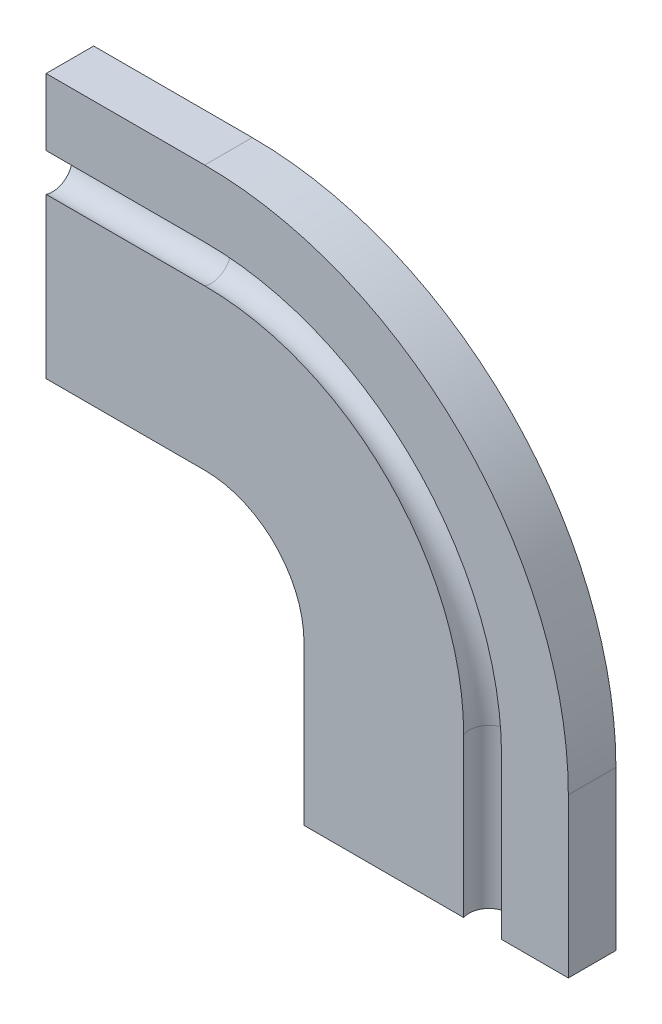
ISO-10303-21;
HEADER;
FILE_DESCRIPTION(('STEP AP214'),'2;1');
FILE_NAME('part.step','',(''),(''),'','','');
FILE_SCHEMA(('AUTOMOTIVE_DESIGN { 1 0 10303 214 1 1 1 1 }'));
ENDSEC;
DATA;
#1=APPLICATION_CONTEXT('core data for automotive mechanical design processes');
#2=APPLICATION_PROTOCOL_DEFINITION('international standard','automotive_design',2000,#1);
#3=PRODUCT_CONTEXT('',#1,'mechanical');
#4=PRODUCT('Part','Part','',(#3));
#5=PRODUCT_RELATED_PRODUCT_CATEGORY('part','',(#4));
#6=PRODUCT_DEFINITION_FORMATION('','',#4);
#7=PRODUCT_DEFINITION_CONTEXT('part definition',#1,'design');
#8=PRODUCT_DEFINITION('design','',#6,#7);
#9=PRODUCT_DEFINITION_SHAPE('','',#8);
#10=(LENGTH_UNIT() NAMED_UNIT(*) SI_UNIT(.MILLI.,.METRE.));
#11=(NAMED_UNIT(*) PLANE_ANGLE_UNIT() SI_UNIT($,.RADIAN.));
#12=(NAMED_UNIT(*) SI_UNIT($,.STERADIAN.) SOLID_ANGLE_UNIT());
#13=UNCERTAINTY_MEASURE_WITH_UNIT(LENGTH_MEASURE(1.E-05),#10,'distance_accuracy_value','');
#14=(GEOMETRIC_REPRESENTATION_CONTEXT(3) GLOBAL_UNCERTAINTY_ASSIGNED_CONTEXT((#13)) GLOBAL_UNIT_ASSIGNED_CONTEXT((#10,
#11,#12)) REPRESENTATION_CONTEXT('',''));
#15=CARTESIAN_POINT('',(0.,0.,0.));
#16=DIRECTION('',(0.,0.,1.));
#17=DIRECTION('',(1.,0.,0.));
#18=AXIS2_PLACEMENT_3D('',#15,#16,#17);
#19=CARTESIAN_POINT('',(-20.,82.572,0.));
#20=DIRECTION('',(-1.,0.,0.));
#21=DIRECTION('',(0.,0.,1.));
#22=AXIS2_PLACEMENT_3D('',#19,#20,#21);
#23=CYLINDRICAL_SURFACE('',#22,3.786);
#24=CARTESIAN_POINT('',(-20.,82.572,0.));
#25=DIRECTION('',(1.,0.,0.));
#26=DIRECTION('',(0.,0.,-1.));
#27=AXIS2_PLACEMENT_3D('',#24,#25,#26);
#28=CIRCLE('',#27,3.786);
#29=CARTESIAN_POINT('',(-20.,78.9859157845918,1.214));
#30=VERTEX_POINT('',#29);
#31=CARTESIAN_POINT('',(-20.,86.1580842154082,1.214));
#32=VERTEX_POINT('',#31);
#33=EDGE_CURVE('E237',#30,#32,#28,.T.);
#34=ORIENTED_EDGE('',*,*,#33,.T.);
#35=DIRECTION('',(-1.,0.,0.));
#36=VECTOR('',#35,1.);
#37=CARTESIAN_POINT('',(-20.,86.1580842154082,1.214));
#38=LINE('',#37,#36);
#39=CARTESIAN_POINT('',(-50.,86.1580842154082,1.214));
#40=VERTEX_POINT('',#39);
#41=EDGE_CURVE('E327',#32,#40,#38,.T.);
#42=ORIENTED_EDGE('',*,*,#41,.T.);
#43=CARTESIAN_POINT('',(-50.,82.572,0.));
#44=DIRECTION('',(1.,0.,0.));
#45=DIRECTION('',(0.,0.,-1.));
#46=AXIS2_PLACEMENT_3D('',#43,#44,#45);
#47=CIRCLE('',#46,3.786);
#48=CARTESIAN_POINT('',(-50.,78.9859157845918,1.214));
#49=VERTEX_POINT('',#48);
#50=EDGE_CURVE('E52',#49,#40,#47,.T.);
#51=ORIENTED_EDGE('',*,*,#50,.F.);
#52=DIRECTION('',(-1.,0.,0.));
#53=VECTOR('',#52,1.);
#54=CARTESIAN_POINT('',(-20.,78.9859157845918,1.214));
#55=LINE('',#54,#53);
#56=EDGE_CURVE('E37',#30,#49,#55,.T.);
#57=ORIENTED_EDGE('',*,*,#56,.F.);
#58=EDGE_LOOP('',(#34,#42,#51,#57));
#59=FACE_BOUND('',#58,.T.);
#60=ADVANCED_FACE('F30',(#59),#23,.F.);
#61=CARTESIAN_POINT('',(-20.,98.786,1.214));
#62=DIRECTION('',(0.,1.,0.));
#63=DIRECTION('',(0.,0.,1.));
#64=AXIS2_PLACEMENT_3D('',#61,#62,#63);
#65=PLANE('',#64);
#66=DIRECTION('',(0.,0.,-1.));
#67=VECTOR('',#66,1.);
#68=CARTESIAN_POINT('',(-20.,98.786,1.214));
#69=LINE('',#68,#67);
#70=CARTESIAN_POINT('',(-20.,98.786,1.214));
#71=VERTEX_POINT('',#70);
#72=CARTESIAN_POINT('',(-20.,98.786,-7.78600000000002));
#73=VERTEX_POINT('',#72);
#74=EDGE_CURVE('E234',#71,#73,#69,.T.);
#75=ORIENTED_EDGE('',*,*,#74,.T.);
#76=DIRECTION('',(-1.,0.,0.));
#77=VECTOR('',#76,1.);
#78=CARTESIAN_POINT('',(-20.,98.786,-7.78600000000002));
#79=LINE('',#78,#77);
#80=CARTESIAN_POINT('',(-50.,98.786,-7.78600000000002));
#81=VERTEX_POINT('',#80);
#82=EDGE_CURVE('E321',#73,#81,#79,.T.);
#83=ORIENTED_EDGE('',*,*,#82,.T.);
#84=DIRECTION('',(0.,0.,-1.));
#85=VECTOR('',#84,1.);
#86=CARTESIAN_POINT('',(-50.,98.786,1.214));
#87=LINE('',#86,#85);
#88=CARTESIAN_POINT('',(-50.,98.786,1.214));
#89=VERTEX_POINT('',#88);
#90=EDGE_CURVE('E292',#89,#81,#87,.T.);
#91=ORIENTED_EDGE('',*,*,#90,.F.);
#92=DIRECTION('',(-1.,0.,0.));
#93=VECTOR('',#92,1.);
#94=CARTESIAN_POINT('',(-20.,98.786,1.214));
#95=LINE('',#94,#93);
#96=EDGE_CURVE('E324',#71,#89,#95,.T.);
#97=ORIENTED_EDGE('',*,*,#96,.F.);
#98=EDGE_LOOP('',(#75,#83,#91,#97));
#99=FACE_BOUND('',#98,.T.);
#100=ADVANCED_FACE('F452',(#99),#65,.T.);
#101=CARTESIAN_POINT('',(-20.,97.572,-7.78600000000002));
#102=DIRECTION('',(0.,-1.,0.));
#103=DIRECTION('',(0.,0.,-1.));
#104=AXIS2_PLACEMENT_3D('',#101,#102,#103);
#105=PLANE('',#104);
#106=DIRECTION('',(0.,0.,1.));
#107=VECTOR('',#106,1.);
#108=CARTESIAN_POINT('',(-20.,97.572,-7.78600000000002));
#109=LINE('',#108,#107);
#110=CARTESIAN_POINT('',(-20.,97.572,-7.78600000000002));
#111=VERTEX_POINT('',#110);
#112=CARTESIAN_POINT('',(-20.,97.572,0.));
#113=VERTEX_POINT('',#112);
#114=EDGE_CURVE('E231',#111,#113,#109,.T.);
#115=ORIENTED_EDGE('',*,*,#114,.T.);
#116=DIRECTION('',(-1.,0.,0.));
#117=VECTOR('',#116,1.);
#118=CARTESIAN_POINT('',(-20.,97.572,0.));
#119=LINE('',#118,#117);
#120=CARTESIAN_POINT('',(-50.,97.572,0.));
#121=VERTEX_POINT('',#120);
#122=EDGE_CURVE('E315',#113,#121,#119,.T.);
#123=ORIENTED_EDGE('',*,*,#122,.T.);
#124=DIRECTION('',(0.,0.,1.));
#125=VECTOR('',#124,1.);
#126=CARTESIAN_POINT('',(-50.,97.572,-7.78600000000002));
#127=LINE('',#126,#125);
#128=CARTESIAN_POINT('',(-50.,97.572,-7.78600000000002));
#129=VERTEX_POINT('',#128);
#130=EDGE_CURVE('E286',#129,#121,#127,.T.);
#131=ORIENTED_EDGE('',*,*,#130,.F.);
#132=DIRECTION('',(-1.,0.,0.));
#133=VECTOR('',#132,1.);
#134=CARTESIAN_POINT('',(-20.,97.572,-7.78600000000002));
#135=LINE('',#134,#133);
#136=EDGE_CURVE('E318',#111,#129,#135,.T.);
#137=ORIENTED_EDGE('',*,*,#136,.F.);
#138=EDGE_LOOP('',(#115,#123,#131,#137));
#139=FACE_BOUND('',#138,.T.);
#140=ADVANCED_FACE('F455',(#139),#105,.T.);
#141=CARTESIAN_POINT('',(-20.,82.572,0.));
#142=DIRECTION('',(-1.,0.,0.));
#143=DIRECTION('',(0.,0.,1.));
#144=AXIS2_PLACEMENT_3D('',#141,#142,#143);
#145=CYLINDRICAL_SURFACE('',#144,5.);
#146=CARTESIAN_POINT('',(-20.,82.572,0.));
#147=DIRECTION('',(-1.,0.,0.));
#148=DIRECTION('',(0.,0.,-1.));
#149=AXIS2_PLACEMENT_3D('',#146,#147,#148);
#150=CIRCLE('',#149,5.);
#151=CARTESIAN_POINT('',(-20.,87.572,0.));
#152=VERTEX_POINT('',#151);
#153=CARTESIAN_POINT('',(-20.,77.572,0.));
#154=VERTEX_POINT('',#153);
#155=EDGE_CURVE('E228',#152,#154,#150,.T.);
#156=ORIENTED_EDGE('',*,*,#155,.T.);
#157=DIRECTION('',(-1.,0.,0.));
#158=VECTOR('',#157,1.);
#159=CARTESIAN_POINT('',(-20.,77.572,0.));
#160=LINE('',#159,#158);
#161=CARTESIAN_POINT('',(-50.,77.572,0.));
#162=VERTEX_POINT('',#161);
#163=EDGE_CURVE('E309',#154,#162,#160,.T.);
#164=ORIENTED_EDGE('',*,*,#163,.T.);
#165=CARTESIAN_POINT('',(-50.,82.572,0.));
#166=DIRECTION('',(-1.,0.,0.));
#167=DIRECTION('',(0.,0.,-1.));
#168=AXIS2_PLACEMENT_3D('',#165,#166,#167);
#169=CIRCLE('',#168,5.);
#170=CARTESIAN_POINT('',(-50.,87.572,0.));
#171=VERTEX_POINT('',#170);
#172=EDGE_CURVE('E280',#171,#162,#169,.T.);
#173=ORIENTED_EDGE('',*,*,#172,.F.);
#174=DIRECTION('',(-1.,0.,0.));
#175=VECTOR('',#174,1.);
#176=CARTESIAN_POINT('',(-20.,87.572,0.));
#177=LINE('',#176,#175);
#178=EDGE_CURVE('E312',#152,#171,#177,.T.);
#179=ORIENTED_EDGE('',*,*,#178,.F.);
#180=EDGE_LOOP('',(#156,#164,#173,#179));
#181=FACE_BOUND('',#180,.T.);
#182=ADVANCED_FACE('F474',(#181),#145,.T.);
#183=CARTESIAN_POINT('',(-20.,50.,0.));
#184=DIRECTION('',(0.,1.,0.));
#185=DIRECTION('',(0.,0.,1.));
#186=AXIS2_PLACEMENT_3D('',#183,#184,#185);
#187=PLANE('',#186);
#188=DIRECTION('',(0.,0.,-1.));
#189=VECTOR('',#188,1.);
#190=CARTESIAN_POINT('',(-20.,50.,0.));
#191=LINE('',#190,#189);
#192=CARTESIAN_POINT('',(-20.,50.,0.));
#193=VERTEX_POINT('',#192);
#194=CARTESIAN_POINT('',(-20.,50.,-7.786));
#195=VERTEX_POINT('',#194);
#196=EDGE_CURVE('E219',#193,#195,#191,.T.);
#197=ORIENTED_EDGE('',*,*,#196,.T.);
#198=DIRECTION('',(-1.,0.,0.));
#199=VECTOR('',#198,1.);
#200=CARTESIAN_POINT('',(-20.,50.,-7.786));
#201=LINE('',#200,#199);
#202=CARTESIAN_POINT('',(-50.,50.,-7.786));
#203=VERTEX_POINT('',#202);
#204=EDGE_CURVE('E303',#195,#203,#201,.T.);
#205=ORIENTED_EDGE('',*,*,#204,.T.);
#206=DIRECTION('',(0.,0.,-1.));
#207=VECTOR('',#206,1.);
#208=CARTESIAN_POINT('',(-50.,50.,0.));
#209=LINE('',#208,#207);
#210=CARTESIAN_POINT('',(-50.,50.,0.));
#211=VERTEX_POINT('',#210);
#212=EDGE_CURVE('E274',#211,#203,#209,.T.);
#213=ORIENTED_EDGE('',*,*,#212,.F.);
#214=DIRECTION('',(-1.,0.,0.));
#215=VECTOR('',#214,1.);
#216=CARTESIAN_POINT('',(-20.,50.,0.));
#217=LINE('',#216,#215);
#218=EDGE_CURVE('E306',#193,#211,#217,.T.);
#219=ORIENTED_EDGE('',*,*,#218,.F.);
#220=EDGE_LOOP('',(#197,#205,#213,#219));
#221=FACE_BOUND('',#220,.T.);
#222=ADVANCED_FACE('F479',(#221),#187,.T.);
#223=CARTESIAN_POINT('',(-20.,48.786,-7.786));
#224=DIRECTION('',(0.,-1.,0.));
#225=DIRECTION('',(0.,0.,-1.));
#226=AXIS2_PLACEMENT_3D('',#223,#224,#225);
#227=PLANE('',#226);
#228=DIRECTION('',(0.,0.,1.));
#229=VECTOR('',#228,1.);
#230=CARTESIAN_POINT('',(-20.,48.786,-7.786));
#231=LINE('',#230,#229);
#232=CARTESIAN_POINT('',(-20.,48.786,-7.786));
#233=VERTEX_POINT('',#232);
#234=CARTESIAN_POINT('',(-20.,48.786,1.214));
#235=VERTEX_POINT('',#234);
#236=EDGE_CURVE('E216',#233,#235,#231,.T.);
#237=ORIENTED_EDGE('',*,*,#236,.T.);
#238=DIRECTION('',(-1.,0.,0.));
#239=VECTOR('',#238,1.);
#240=CARTESIAN_POINT('',(-20.,48.786,1.214));
#241=LINE('',#240,#239);
#242=CARTESIAN_POINT('',(-50.,48.786,1.214));
#243=VERTEX_POINT('',#242);
#244=EDGE_CURVE('E11',#235,#243,#241,.T.);
#245=ORIENTED_EDGE('',*,*,#244,.T.);
#246=DIRECTION('',(0.,0.,1.));
#247=VECTOR('',#246,1.);
#248=CARTESIAN_POINT('',(-50.,48.786,-7.786));
#249=LINE('',#248,#247);
#250=CARTESIAN_POINT('',(-50.,48.786,-7.786));
#251=VERTEX_POINT('',#250);
#252=EDGE_CURVE('E199',#251,#243,#249,.T.);
#253=ORIENTED_EDGE('',*,*,#252,.F.);
#254=DIRECTION('',(-1.,0.,0.));
#255=VECTOR('',#254,1.);
#256=CARTESIAN_POINT('',(-20.,48.786,-7.786));
#257=LINE('',#256,#255);
#258=EDGE_CURVE('E300',#233,#251,#257,.T.);
#259=ORIENTED_EDGE('',*,*,#258,.F.);
#260=EDGE_LOOP('',(#237,#245,#253,#259));
#261=FACE_BOUND('',#260,.T.);
#262=ADVANCED_FACE('F342',(#261),#227,.T.);
#263=CARTESIAN_POINT('',(-20.,30.,0.));
#264=DIRECTION('',(0.,0.,1.));
#265=DIRECTION('',(1.,0.,0.));
#266=AXIS2_PLACEMENT_3D('',#263,#264,#265);
#267=TOROIDAL_SURFACE('',#266,52.572,3.786);
#268=CARTESIAN_POINT('',(32.572,30.,0.));
#269=DIRECTION('',(0.,-1.,0.));
#270=DIRECTION('',(0.,0.,-1.));
#271=AXIS2_PLACEMENT_3D('',#268,#269,#270);
#272=CIRCLE('',#271,3.786);
#273=CARTESIAN_POINT('',(28.9859157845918,30.,1.214));
#274=VERTEX_POINT('',#273);
#275=CARTESIAN_POINT('',(36.1580842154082,30.,1.214));
#276=VERTEX_POINT('',#275);
#277=EDGE_CURVE('E210',#274,#276,#272,.T.);
#278=ORIENTED_EDGE('',*,*,#277,.T.);
#279=CARTESIAN_POINT('',(-20.,30.,1.214));
#280=DIRECTION('',(0.,0.,1.));
#281=DIRECTION('',(1.,0.,0.));
#282=AXIS2_PLACEMENT_3D('',#279,#280,#281);
#283=CIRCLE('',#282,56.1580842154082);
#284=EDGE_CURVE('E265',#276,#32,#283,.T.);
#285=ORIENTED_EDGE('',*,*,#284,.T.);
#286=ORIENTED_EDGE('',*,*,#33,.F.);
#287=CARTESIAN_POINT('',(-20.,30.,1.214));
#288=DIRECTION('',(0.,0.,1.));
#289=DIRECTION('',(1.,0.,0.));
#290=AXIS2_PLACEMENT_3D('',#287,#288,#289);
#291=CIRCLE('',#290,48.9859157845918);
#292=EDGE_CURVE('E200',#274,#30,#291,.T.);
#293=ORIENTED_EDGE('',*,*,#292,.F.);
#294=EDGE_LOOP('',(#278,#285,#286,#293));
#295=FACE_BOUND('',#294,.T.);
#296=ADVANCED_FACE('F332',(#295),#267,.F.);
#297=CARTESIAN_POINT('',(-20.,30.,0.));
#298=DIRECTION('',(0.,0.,1.));
#299=DIRECTION('',(1.,0.,0.));
#300=AXIS2_PLACEMENT_3D('',#297,#298,#299);
#301=CYLINDRICAL_SURFACE('',#300,68.786);
#302=DIRECTION('',(0.,0.,-1.));
#303=VECTOR('',#302,1.);
#304=CARTESIAN_POINT('',(48.786,30.,1.214));
#305=LINE('',#304,#303);
#306=CARTESIAN_POINT('',(48.786,30.,1.214));
#307=VERTEX_POINT('',#306);
#308=CARTESIAN_POINT('',(48.786,30.,-7.78600000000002));
#309=VERTEX_POINT('',#308);
#310=EDGE_CURVE('E386',#307,#309,#305,.T.);
#311=ORIENTED_EDGE('',*,*,#310,.T.);
#312=CARTESIAN_POINT('',(-20.,30.,-7.78600000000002));
#313=DIRECTION('',(0.,0.,1.));
#314=DIRECTION('',(1.,0.,0.));
#315=AXIS2_PLACEMENT_3D('',#312,#313,#314);
#316=CIRCLE('',#315,68.786);
#317=EDGE_CURVE('E259',#309,#73,#316,.T.);
#318=ORIENTED_EDGE('',*,*,#317,.T.);
#319=ORIENTED_EDGE('',*,*,#74,.F.);
#320=CARTESIAN_POINT('',(-20.,30.,1.214));
#321=DIRECTION('',(0.,0.,1.));
#322=DIRECTION('',(1.,0.,0.));
#323=AXIS2_PLACEMENT_3D('',#320,#321,#322);
#324=CIRCLE('',#323,68.786);
#325=EDGE_CURVE('E262',#307,#71,#324,.T.);
#326=ORIENTED_EDGE('',*,*,#325,.F.);
#327=EDGE_LOOP('',(#311,#318,#319,#326));
#328=FACE_BOUND('',#327,.T.);
#329=ADVANCED_FACE('F450',(#328),#301,.T.);
#330=CARTESIAN_POINT('',(-20.,30.,0.));
#331=DIRECTION('',(0.,0.,1.));
#332=DIRECTION('',(1.,0.,0.));
#333=AXIS2_PLACEMENT_3D('',#330,#331,#332);
#334=CYLINDRICAL_SURFACE('',#333,67.572);
#335=DIRECTION('',(0.,0.,1.));
#336=VECTOR('',#335,1.);
#337=CARTESIAN_POINT('',(47.572,30.,-7.78600000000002));
#338=LINE('',#337,#336);
#339=CARTESIAN_POINT('',(47.572,30.,-7.78600000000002));
#340=VERTEX_POINT('',#339);
#341=CARTESIAN_POINT('',(47.572,30.,0.));
#342=VERTEX_POINT('',#341);
#343=EDGE_CURVE('E422',#340,#342,#338,.T.);
#344=ORIENTED_EDGE('',*,*,#343,.T.);
#345=CARTESIAN_POINT('',(-20.,30.,0.));
#346=DIRECTION('',(0.,0.,1.));
#347=DIRECTION('',(1.,0.,0.));
#348=AXIS2_PLACEMENT_3D('',#345,#346,#347);
#349=CIRCLE('',#348,67.572);
#350=EDGE_CURVE('E253',#342,#113,#349,.T.);
#351=ORIENTED_EDGE('',*,*,#350,.T.);
#352=ORIENTED_EDGE('',*,*,#114,.F.);
#353=CARTESIAN_POINT('',(-20.,30.,-7.78600000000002));
#354=DIRECTION('',(0.,0.,1.));
#355=DIRECTION('',(1.,0.,0.));
#356=AXIS2_PLACEMENT_3D('',#353,#354,#355);
#357=CIRCLE('',#356,67.572);
#358=EDGE_CURVE('E256',#340,#111,#357,.T.);
#359=ORIENTED_EDGE('',*,*,#358,.F.);
#360=EDGE_LOOP('',(#344,#351,#352,#359));
#361=FACE_BOUND('',#360,.T.);
#362=ADVANCED_FACE('F457',(#361),#334,.F.);
#363=CARTESIAN_POINT('',(-20.,30.,0.));
#364=DIRECTION('',(0.,0.,1.));
#365=DIRECTION('',(1.,0.,0.));
#366=AXIS2_PLACEMENT_3D('',#363,#364,#365);
#367=TOROIDAL_SURFACE('',#366,52.572,5.);
#368=CARTESIAN_POINT('',(32.572,30.,0.));
#369=DIRECTION('',(0.,1.,0.));
#370=DIRECTION('',(0.,0.,-1.));
#371=AXIS2_PLACEMENT_3D('',#368,#369,#370);
#372=CIRCLE('',#371,5.);
#373=CARTESIAN_POINT('',(37.572,30.,0.));
#374=VERTEX_POINT('',#373);
#375=CARTESIAN_POINT('',(27.572,30.,0.));
#376=VERTEX_POINT('',#375);
#377=EDGE_CURVE('E354',#374,#376,#372,.T.);
#378=ORIENTED_EDGE('',*,*,#377,.T.);
#379=CARTESIAN_POINT('',(-20.,30.,0.));
#380=DIRECTION('',(0.,0.,1.));
#381=DIRECTION('',(1.,0.,0.));
#382=AXIS2_PLACEMENT_3D('',#379,#380,#381);
#383=CIRCLE('',#382,47.572);
#384=EDGE_CURVE('E247',#376,#154,#383,.T.);
#385=ORIENTED_EDGE('',*,*,#384,.T.);
#386=ORIENTED_EDGE('',*,*,#155,.F.);
#387=CARTESIAN_POINT('',(-20.,30.,0.));
#388=DIRECTION('',(0.,0.,1.));
#389=DIRECTION('',(1.,0.,0.));
#390=AXIS2_PLACEMENT_3D('',#387,#388,#389);
#391=CIRCLE('',#390,57.572);
#392=EDGE_CURVE('E250',#374,#152,#391,.T.);
#393=ORIENTED_EDGE('',*,*,#392,.F.);
#394=EDGE_LOOP('',(#378,#385,#386,#393));
#395=FACE_BOUND('',#394,.T.);
#396=ADVANCED_FACE('F430',(#395),#367,.T.);
#397=CARTESIAN_POINT('',(-20.,30.,0.));
#398=DIRECTION('',(0.,0.,1.));
#399=DIRECTION('',(1.,0.,0.));
#400=AXIS2_PLACEMENT_3D('',#397,#398,#399);
#401=CYLINDRICAL_SURFACE('',#400,20.);
#402=DIRECTION('',(0.,0.,-1.));
#403=VECTOR('',#402,1.);
#404=CARTESIAN_POINT('',(0.,30.,0.));
#405=LINE('',#404,#403);
#406=CARTESIAN_POINT('',(0.,30.,0.));
#407=VERTEX_POINT('',#406);
#408=CARTESIAN_POINT('',(0.,30.,-7.786));
#409=VERTEX_POINT('',#408);
#410=EDGE_CURVE('E349',#407,#409,#405,.T.);
#411=ORIENTED_EDGE('',*,*,#410,.T.);
#412=CARTESIAN_POINT('',(-20.,30.,-7.786));
#413=DIRECTION('',(0.,0.,1.));
#414=DIRECTION('',(1.,0.,0.));
#415=AXIS2_PLACEMENT_3D('',#412,#413,#414);
#416=CIRCLE('',#415,20.);
#417=EDGE_CURVE('E241',#409,#195,#416,.T.);
#418=ORIENTED_EDGE('',*,*,#417,.T.);
#419=ORIENTED_EDGE('',*,*,#196,.F.);
#420=CARTESIAN_POINT('',(-20.,30.,0.));
#421=DIRECTION('',(0.,0.,1.));
#422=DIRECTION('',(1.,0.,0.));
#423=AXIS2_PLACEMENT_3D('',#420,#421,#422);
#424=CIRCLE('',#423,20.);
#425=EDGE_CURVE('E244',#407,#193,#424,.T.);
#426=ORIENTED_EDGE('',*,*,#425,.F.);
#427=EDGE_LOOP('',(#411,#418,#419,#426));
#428=FACE_BOUND('',#427,.T.);
#429=ADVANCED_FACE('F464',(#428),#401,.T.);
#430=CARTESIAN_POINT('',(-20.,30.,0.));
#431=DIRECTION('',(0.,0.,1.));
#432=DIRECTION('',(1.,0.,0.));
#433=AXIS2_PLACEMENT_3D('',#430,#431,#432);
#434=CYLINDRICAL_SURFACE('',#433,18.786);
#435=DIRECTION('',(0.,0.,1.));
#436=VECTOR('',#435,1.);
#437=CARTESIAN_POINT('',(-1.214,30.,-7.786));
#438=LINE('',#437,#436);
#439=CARTESIAN_POINT('',(-1.214,30.,-7.786));
#440=VERTEX_POINT('',#439);
#441=CARTESIAN_POINT('',(-1.214,30.,1.214));
#442=VERTEX_POINT('',#441);
#443=EDGE_CURVE('E203',#440,#442,#438,.T.);
#444=ORIENTED_EDGE('',*,*,#443,.T.);
#445=CARTESIAN_POINT('',(-20.,30.,1.214));
#446=DIRECTION('',(0.,0.,1.));
#447=DIRECTION('',(1.,0.,0.));
#448=AXIS2_PLACEMENT_3D('',#445,#446,#447);
#449=CIRCLE('',#448,18.786);
#450=EDGE_CURVE('E190',#442,#235,#449,.T.);
#451=ORIENTED_EDGE('',*,*,#450,.T.);
#452=ORIENTED_EDGE('',*,*,#236,.F.);
#453=CARTESIAN_POINT('',(-20.,30.,-7.786));
#454=DIRECTION('',(0.,0.,1.));
#455=DIRECTION('',(1.,0.,0.));
#456=AXIS2_PLACEMENT_3D('',#453,#454,#455);
#457=CIRCLE('',#456,18.786);
#458=EDGE_CURVE('E206',#440,#233,#457,.T.);
#459=ORIENTED_EDGE('',*,*,#458,.F.);
#460=EDGE_LOOP('',(#444,#451,#452,#459));
#461=FACE_BOUND('',#460,.T.);
#462=ADVANCED_FACE('F204',(#461),#434,.F.);
#463=CARTESIAN_POINT('',(-1.214,30.,-7.786));
#464=DIRECTION('',(1.,0.,0.));
#465=DIRECTION('',(0.,0.,-1.));
#466=AXIS2_PLACEMENT_3D('',#463,#464,#465);
#467=PLANE('',#466);
#468=DIRECTION('',(0.,0.,1.));
#469=VECTOR('',#468,1.);
#470=CARTESIAN_POINT('',(-1.214,0.,-7.786));
#471=LINE('',#470,#469);
#472=CARTESIAN_POINT('',(-1.214,0.,-7.786));
#473=VERTEX_POINT('',#472);
#474=CARTESIAN_POINT('',(-1.214,0.,1.214));
#475=VERTEX_POINT('',#474);
#476=EDGE_CURVE('E215',#473,#475,#471,.T.);
#477=ORIENTED_EDGE('',*,*,#476,.T.);
#478=DIRECTION('',(0.,-1.,0.));
#479=VECTOR('',#478,1.);
#480=CARTESIAN_POINT('',(-1.214,30.,1.214));
#481=LINE('',#480,#479);
#482=EDGE_CURVE('E194',#442,#475,#481,.T.);
#483=ORIENTED_EDGE('',*,*,#482,.F.);
#484=ORIENTED_EDGE('',*,*,#443,.F.);
#485=DIRECTION('',(0.,-1.,0.));
#486=VECTOR('',#485,1.);
#487=CARTESIAN_POINT('',(-1.214,30.,-7.786));
#488=LINE('',#487,#486);
#489=EDGE_CURVE('E345',#440,#473,#488,.T.);
#490=ORIENTED_EDGE('',*,*,#489,.T.);
#491=EDGE_LOOP('',(#477,#483,#484,#490));
#492=FACE_BOUND('',#491,.T.);
#493=ADVANCED_FACE('F213',(#492),#467,.F.);
#494=CARTESIAN_POINT('',(-1.214,30.,1.214));
#495=DIRECTION('',(0.,0.,-1.));
#496=DIRECTION('',(-1.,0.,0.));
#497=AXIS2_PLACEMENT_3D('',#494,#495,#496);
#498=PLANE('',#497);
#499=DIRECTION('',(1.,0.,0.));
#500=VECTOR('',#499,1.);
#501=CARTESIAN_POINT('',(-1.214,0.,1.214));
#502=LINE('',#501,#500);
#503=CARTESIAN_POINT('',(28.9859157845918,0.,1.214));
#504=VERTEX_POINT('',#503);
#505=EDGE_CURVE('E415',#475,#504,#502,.T.);
#506=ORIENTED_EDGE('',*,*,#505,.T.);
#507=DIRECTION('',(0.,-1.,0.));
#508=VECTOR('',#507,1.);
#509=CARTESIAN_POINT('',(28.9859157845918,30.,1.214));
#510=LINE('',#509,#508);
#511=EDGE_CURVE('E217',#274,#504,#510,.T.);
#512=ORIENTED_EDGE('',*,*,#511,.F.);
#513=ORIENTED_EDGE('',*,*,#292,.T.);
#514=ORIENTED_EDGE('',*,*,#56,.T.);
#515=DIRECTION('',(0.,1.,0.));
#516=VECTOR('',#515,1.);
#517=CARTESIAN_POINT('',(-50.,48.786,1.214));
#518=LINE('',#517,#516);
#519=EDGE_CURVE('E44',#243,#49,#518,.T.);
#520=ORIENTED_EDGE('',*,*,#519,.F.);
#521=ORIENTED_EDGE('',*,*,#244,.F.);
#522=ORIENTED_EDGE('',*,*,#450,.F.);
#523=ORIENTED_EDGE('',*,*,#482,.T.);
#524=EDGE_LOOP('',(#506,#512,#513,#514,#520,#521,#522,#523));
#525=FACE_BOUND('',#524,.T.);
#526=ADVANCED_FACE('F192',(#525),#498,.F.);
#527=CARTESIAN_POINT('',(32.572,30.,0.));
#528=DIRECTION('',(0.,-1.,0.));
#529=DIRECTION('',(0.,0.,-1.));
#530=AXIS2_PLACEMENT_3D('',#527,#528,#529);
#531=CYLINDRICAL_SURFACE('',#530,3.786);
#532=CARTESIAN_POINT('',(32.572,0.,0.));
#533=DIRECTION('',(0.,-1.,0.));
#534=DIRECTION('',(0.,0.,-1.));
#535=AXIS2_PLACEMENT_3D('',#532,#533,#534);
#536=CIRCLE('',#535,3.786);
#537=CARTESIAN_POINT('',(36.1580842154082,0.,1.214));
#538=VERTEX_POINT('',#537);
#539=EDGE_CURVE('E397',#504,#538,#536,.T.);
#540=ORIENTED_EDGE('',*,*,#539,.T.);
#541=DIRECTION('',(0.,-1.,0.));
#542=VECTOR('',#541,1.);
#543=CARTESIAN_POINT('',(36.1580842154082,30.,1.214));
#544=LINE('',#543,#542);
#545=EDGE_CURVE('E222',#276,#538,#544,.T.);
#546=ORIENTED_EDGE('',*,*,#545,.F.);
#547=ORIENTED_EDGE('',*,*,#277,.F.);
#548=ORIENTED_EDGE('',*,*,#511,.T.);
#549=EDGE_LOOP('',(#540,#546,#547,#548));
#550=FACE_BOUND('',#549,.T.);
#551=ADVANCED_FACE('F420',(#550),#531,.F.);
#552=CARTESIAN_POINT('',(36.1580842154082,30.,1.214));
#553=DIRECTION('',(0.,0.,-1.));
#554=DIRECTION('',(-1.,0.,0.));
#555=AXIS2_PLACEMENT_3D('',#552,#553,#554);
#556=PLANE('',#555);
#557=DIRECTION('',(1.,0.,0.));
#558=VECTOR('',#557,1.);
#559=CARTESIAN_POINT('',(36.1580842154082,0.,1.214));
#560=LINE('',#559,#558);
#561=CARTESIAN_POINT('',(48.786,0.,1.214));
#562=VERTEX_POINT('',#561);
#563=EDGE_CURVE('E391',#538,#562,#560,.T.);
#564=ORIENTED_EDGE('',*,*,#563,.T.);
#565=DIRECTION('',(0.,-1.,0.));
#566=VECTOR('',#565,1.);
#567=CARTESIAN_POINT('',(48.786,30.,1.214));
#568=LINE('',#567,#566);
#569=EDGE_CURVE('E376',#307,#562,#568,.T.);
#570=ORIENTED_EDGE('',*,*,#569,.F.);
#571=ORIENTED_EDGE('',*,*,#325,.T.);
#572=ORIENTED_EDGE('',*,*,#96,.T.);
#573=DIRECTION('',(0.,1.,0.));
#574=VECTOR('',#573,1.);
#575=CARTESIAN_POINT('',(-50.,86.1580842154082,1.214));
#576=LINE('',#575,#574);
#577=EDGE_CURVE('E295',#40,#89,#576,.T.);
#578=ORIENTED_EDGE('',*,*,#577,.F.);
#579=ORIENTED_EDGE('',*,*,#41,.F.);
#580=ORIENTED_EDGE('',*,*,#284,.F.);
#581=ORIENTED_EDGE('',*,*,#545,.T.);
#582=EDGE_LOOP('',(#564,#570,#571,#572,#578,#579,#580,#581));
#583=FACE_BOUND('',#582,.T.);
#584=ADVANCED_FACE('F337',(#583),#556,.F.);
#585=CARTESIAN_POINT('',(48.786,30.,1.214));
#586=DIRECTION('',(-1.,0.,0.));
#587=DIRECTION('',(0.,0.,1.));
#588=AXIS2_PLACEMENT_3D('',#585,#586,#587);
#589=PLANE('',#588);
#590=DIRECTION('',(0.,0.,-1.));
#591=VECTOR('',#590,1.);
#592=CARTESIAN_POINT('',(48.786,0.,1.214));
#593=LINE('',#592,#591);
#594=CARTESIAN_POINT('',(48.786,0.,-7.78600000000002));
#595=VERTEX_POINT('',#594);
#596=EDGE_CURVE('E384',#562,#595,#593,.T.);
#597=ORIENTED_EDGE('',*,*,#596,.T.);
#598=DIRECTION('',(0.,-1.,0.));
#599=VECTOR('',#598,1.);
#600=CARTESIAN_POINT('',(48.786,30.,-7.78600000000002));
#601=LINE('',#600,#599);
#602=EDGE_CURVE('E373',#309,#595,#601,.T.);
#603=ORIENTED_EDGE('',*,*,#602,.F.);
#604=ORIENTED_EDGE('',*,*,#310,.F.);
#605=ORIENTED_EDGE('',*,*,#569,.T.);
#606=EDGE_LOOP('',(#597,#603,#604,#605));
#607=FACE_BOUND('',#606,.T.);
#608=ADVANCED_FACE('F382',(#607),#589,.F.);
#609=CARTESIAN_POINT('',(48.786,30.,-7.78600000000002));
#610=DIRECTION('',(0.,0.,1.));
#611=DIRECTION('',(1.,0.,0.));
#612=AXIS2_PLACEMENT_3D('',#609,#610,#611);
#613=PLANE('',#612);
#614=DIRECTION('',(-1.,0.,0.));
#615=VECTOR('',#614,1.);
#616=CARTESIAN_POINT('',(48.786,0.,-7.78600000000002));
#617=LINE('',#616,#615);
#618=CARTESIAN_POINT('',(47.572,0.,-7.78600000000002));
#619=VERTEX_POINT('',#618);
#620=EDGE_CURVE('E393',#595,#619,#617,.T.);
#621=ORIENTED_EDGE('',*,*,#620,.T.);
#622=DIRECTION('',(0.,-1.,0.));
#623=VECTOR('',#622,1.);
#624=CARTESIAN_POINT('',(47.572,30.,-7.78600000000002));
#625=LINE('',#624,#623);
#626=EDGE_CURVE('E370',#340,#619,#625,.T.);
#627=ORIENTED_EDGE('',*,*,#626,.F.);
#628=ORIENTED_EDGE('',*,*,#358,.T.);
#629=ORIENTED_EDGE('',*,*,#136,.T.);
#630=DIRECTION('',(0.,-1.,0.));
#631=VECTOR('',#630,1.);
#632=CARTESIAN_POINT('',(-50.,98.786,-7.78600000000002));
#633=LINE('',#632,#631);
#634=EDGE_CURVE('E289',#81,#129,#633,.T.);
#635=ORIENTED_EDGE('',*,*,#634,.F.);
#636=ORIENTED_EDGE('',*,*,#82,.F.);
#637=ORIENTED_EDGE('',*,*,#317,.F.);
#638=ORIENTED_EDGE('',*,*,#602,.T.);
#639=EDGE_LOOP('',(#621,#627,#628,#629,#635,#636,#637,#638));
#640=FACE_BOUND('',#639,.T.);
#641=ADVANCED_FACE('F447',(#640),#613,.F.);
#642=CARTESIAN_POINT('',(47.572,30.,-7.78600000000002));
#643=DIRECTION('',(1.,0.,0.));
#644=DIRECTION('',(0.,0.,-1.));
#645=AXIS2_PLACEMENT_3D('',#642,#643,#644);
#646=PLANE('',#645);
#647=DIRECTION('',(0.,0.,1.));
#648=VECTOR('',#647,1.);
#649=CARTESIAN_POINT('',(47.572,0.,-7.78600000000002));
#650=LINE('',#649,#648);
#651=CARTESIAN_POINT('',(47.572,0.,0.));
#652=VERTEX_POINT('',#651);
#653=EDGE_CURVE('E395',#619,#652,#650,.T.);
#654=ORIENTED_EDGE('',*,*,#653,.T.);
#655=DIRECTION('',(0.,-1.,0.));
#656=VECTOR('',#655,1.);
#657=CARTESIAN_POINT('',(47.572,30.,0.));
#658=LINE('',#657,#656);
#659=EDGE_CURVE('E367',#342,#652,#658,.T.);
#660=ORIENTED_EDGE('',*,*,#659,.F.);
#661=ORIENTED_EDGE('',*,*,#343,.F.);
#662=ORIENTED_EDGE('',*,*,#626,.T.);
#663=EDGE_LOOP('',(#654,#660,#661,#662));
#664=FACE_BOUND('',#663,.T.);
#665=ADVANCED_FACE('F444',(#664),#646,.F.);
#666=CARTESIAN_POINT('',(47.572,30.,0.));
#667=DIRECTION('',(0.,0.,1.));
#668=DIRECTION('',(1.,0.,0.));
#669=AXIS2_PLACEMENT_3D('',#666,#667,#668);
#670=PLANE('',#669);
#671=DIRECTION('',(-1.,0.,0.));
#672=VECTOR('',#671,1.);
#673=CARTESIAN_POINT('',(47.572,0.,0.));
#674=LINE('',#673,#672);
#675=CARTESIAN_POINT('',(37.572,0.,0.));
#676=VERTEX_POINT('',#675);
#677=EDGE_CURVE('E402',#652,#676,#674,.T.);
#678=ORIENTED_EDGE('',*,*,#677,.T.);
#679=DIRECTION('',(0.,-1.,0.));
#680=VECTOR('',#679,1.);
#681=CARTESIAN_POINT('',(37.572,30.,0.));
#682=LINE('',#681,#680);
#683=EDGE_CURVE('E364',#374,#676,#682,.T.);
#684=ORIENTED_EDGE('',*,*,#683,.F.);
#685=ORIENTED_EDGE('',*,*,#392,.T.);
#686=ORIENTED_EDGE('',*,*,#178,.T.);
#687=DIRECTION('',(0.,-1.,0.));
#688=VECTOR('',#687,1.);
#689=CARTESIAN_POINT('',(-50.,97.572,0.));
#690=LINE('',#689,#688);
#691=EDGE_CURVE('E283',#121,#171,#690,.T.);
#692=ORIENTED_EDGE('',*,*,#691,.F.);
#693=ORIENTED_EDGE('',*,*,#122,.F.);
#694=ORIENTED_EDGE('',*,*,#350,.F.);
#695=ORIENTED_EDGE('',*,*,#659,.T.);
#696=EDGE_LOOP('',(#678,#684,#685,#686,#692,#693,#694,#695));
#697=FACE_BOUND('',#696,.T.);
#698=ADVANCED_FACE('F440',(#697),#670,.F.);
#699=CARTESIAN_POINT('',(32.572,30.,0.));
#700=DIRECTION('',(0.,-1.,0.));
#701=DIRECTION('',(0.,0.,-1.));
#702=AXIS2_PLACEMENT_3D('',#699,#700,#701);
#703=CYLINDRICAL_SURFACE('',#702,5.);
#704=CARTESIAN_POINT('',(32.572,0.,0.));
#705=DIRECTION('',(0.,1.,0.));
#706=DIRECTION('',(0.,0.,-1.));
#707=AXIS2_PLACEMENT_3D('',#704,#705,#706);
#708=CIRCLE('',#707,5.);
#709=CARTESIAN_POINT('',(27.572,0.,0.));
#710=VERTEX_POINT('',#709);
#711=EDGE_CURVE('E404',#676,#710,#708,.T.);
#712=ORIENTED_EDGE('',*,*,#711,.T.);
#713=DIRECTION('',(0.,-1.,0.));
#714=VECTOR('',#713,1.);
#715=CARTESIAN_POINT('',(27.572,30.,0.));
#716=LINE('',#715,#714);
#717=EDGE_CURVE('E361',#376,#710,#716,.T.);
#718=ORIENTED_EDGE('',*,*,#717,.F.);
#719=ORIENTED_EDGE('',*,*,#377,.F.);
#720=ORIENTED_EDGE('',*,*,#683,.T.);
#721=EDGE_LOOP('',(#712,#718,#719,#720));
#722=FACE_BOUND('',#721,.T.);
#723=ADVANCED_FACE('F434',(#722),#703,.T.);
#724=CARTESIAN_POINT('',(27.572,30.,0.));
#725=DIRECTION('',(0.,0.,1.));
#726=DIRECTION('',(1.,0.,0.));
#727=AXIS2_PLACEMENT_3D('',#724,#725,#726);
#728=PLANE('',#727);
#729=DIRECTION('',(-1.,0.,0.));
#730=VECTOR('',#729,1.);
#731=CARTESIAN_POINT('',(27.572,0.,0.));
#732=LINE('',#731,#730);
#733=CARTESIAN_POINT('',(0.,0.,0.));
#734=VERTEX_POINT('',#733);
#735=EDGE_CURVE('E406',#710,#734,#732,.T.);
#736=ORIENTED_EDGE('',*,*,#735,.T.);
#737=DIRECTION('',(0.,-1.,0.));
#738=VECTOR('',#737,1.);
#739=CARTESIAN_POINT('',(0.,30.,0.));
#740=LINE('',#739,#738);
#741=EDGE_CURVE('E351',#407,#734,#740,.T.);
#742=ORIENTED_EDGE('',*,*,#741,.F.);
#743=ORIENTED_EDGE('',*,*,#425,.T.);
#744=ORIENTED_EDGE('',*,*,#218,.T.);
#745=DIRECTION('',(0.,-1.,0.));
#746=VECTOR('',#745,1.);
#747=CARTESIAN_POINT('',(-50.,77.572,0.));
#748=LINE('',#747,#746);
#749=EDGE_CURVE('E277',#162,#211,#748,.T.);
#750=ORIENTED_EDGE('',*,*,#749,.F.);
#751=ORIENTED_EDGE('',*,*,#163,.F.);
#752=ORIENTED_EDGE('',*,*,#384,.F.);
#753=ORIENTED_EDGE('',*,*,#717,.T.);
#754=EDGE_LOOP('',(#736,#742,#743,#744,#750,#751,#752,#753));
#755=FACE_BOUND('',#754,.T.);
#756=ADVANCED_FACE('F437',(#755),#728,.F.);
#757=CARTESIAN_POINT('',(0.,30.,0.));
#758=DIRECTION('',(-1.,0.,0.));
#759=DIRECTION('',(0.,0.,1.));
#760=AXIS2_PLACEMENT_3D('',#757,#758,#759);
#761=PLANE('',#760);
#762=DIRECTION('',(0.,0.,-1.));
#763=VECTOR('',#762,1.);
#764=CARTESIAN_POINT('',(0.,0.,0.));
#765=LINE('',#764,#763);
#766=CARTESIAN_POINT('',(0.,0.,-7.786));
#767=VERTEX_POINT('',#766);
#768=EDGE_CURVE('E407',#734,#767,#765,.T.);
#769=ORIENTED_EDGE('',*,*,#768,.T.);
#770=DIRECTION('',(0.,-1.,0.));
#771=VECTOR('',#770,1.);
#772=CARTESIAN_POINT('',(0.,30.,-7.786));
#773=LINE('',#772,#771);
#774=EDGE_CURVE('E348',#409,#767,#773,.T.);
#775=ORIENTED_EDGE('',*,*,#774,.F.);
#776=ORIENTED_EDGE('',*,*,#410,.F.);
#777=ORIENTED_EDGE('',*,*,#741,.T.);
#778=EDGE_LOOP('',(#769,#775,#776,#777));
#779=FACE_BOUND('',#778,.T.);
#780=ADVANCED_FACE('F411',(#779),#761,.F.);
#781=CARTESIAN_POINT('',(0.,30.,-7.786));
#782=DIRECTION('',(0.,0.,1.));
#783=DIRECTION('',(1.,0.,0.));
#784=AXIS2_PLACEMENT_3D('',#781,#782,#783);
#785=PLANE('',#784);
#786=DIRECTION('',(-1.,0.,0.));
#787=VECTOR('',#786,1.);
#788=CARTESIAN_POINT('',(0.,0.,-7.786));
#789=LINE('',#788,#787);
#790=EDGE_CURVE('E211',#767,#473,#789,.T.);
#791=ORIENTED_EDGE('',*,*,#790,.T.);
#792=ORIENTED_EDGE('',*,*,#489,.F.);
#793=ORIENTED_EDGE('',*,*,#458,.T.);
#794=ORIENTED_EDGE('',*,*,#258,.T.);
#795=DIRECTION('',(0.,-1.,0.));
#796=VECTOR('',#795,1.);
#797=CARTESIAN_POINT('',(-50.,50.,-7.786));
#798=LINE('',#797,#796);
#799=EDGE_CURVE('E271',#203,#251,#798,.T.);
#800=ORIENTED_EDGE('',*,*,#799,.F.);
#801=ORIENTED_EDGE('',*,*,#204,.F.);
#802=ORIENTED_EDGE('',*,*,#417,.F.);
#803=ORIENTED_EDGE('',*,*,#774,.T.);
#804=EDGE_LOOP('',(#791,#792,#793,#794,#800,#801,#802,#803));
#805=FACE_BOUND('',#804,.T.);
#806=ADVANCED_FACE('F344',(#805),#785,.F.);
#807=CARTESIAN_POINT('',(-50.,82.572,0.));
#808=DIRECTION('',(1.,0.,0.));
#809=DIRECTION('',(0.,0.,-1.));
#810=AXIS2_PLACEMENT_3D('',#807,#808,#809);
#811=PLANE('',#810);
#812=ORIENTED_EDGE('',*,*,#252,.T.);
#813=ORIENTED_EDGE('',*,*,#519,.T.);
#814=ORIENTED_EDGE('',*,*,#50,.T.);
#815=ORIENTED_EDGE('',*,*,#577,.T.);
#816=ORIENTED_EDGE('',*,*,#90,.T.);
#817=ORIENTED_EDGE('',*,*,#634,.T.);
#818=ORIENTED_EDGE('',*,*,#130,.T.);
#819=ORIENTED_EDGE('',*,*,#691,.T.);
#820=ORIENTED_EDGE('',*,*,#172,.T.);
#821=ORIENTED_EDGE('',*,*,#749,.T.);
#822=ORIENTED_EDGE('',*,*,#212,.T.);
#823=ORIENTED_EDGE('',*,*,#799,.T.);
#824=EDGE_LOOP('',(#812,#813,#814,#815,#816,#817,#818,#819,#820,#821,#822,#823));
#825=FACE_BOUND('',#824,.T.);
#826=ADVANCED_FACE('F340',(#825),#811,.F.);
#827=CARTESIAN_POINT('',(32.572,0.,0.));
#828=DIRECTION('',(0.,-1.,0.));
#829=DIRECTION('',(0.,0.,-1.));
#830=AXIS2_PLACEMENT_3D('',#827,#828,#829);
#831=PLANE('',#830);
#832=ORIENTED_EDGE('',*,*,#476,.F.);
#833=ORIENTED_EDGE('',*,*,#790,.F.);
#834=ORIENTED_EDGE('',*,*,#768,.F.);
#835=ORIENTED_EDGE('',*,*,#735,.F.);
#836=ORIENTED_EDGE('',*,*,#711,.F.);
#837=ORIENTED_EDGE('',*,*,#677,.F.);
#838=ORIENTED_EDGE('',*,*,#653,.F.);
#839=ORIENTED_EDGE('',*,*,#620,.F.);
#840=ORIENTED_EDGE('',*,*,#596,.F.);
#841=ORIENTED_EDGE('',*,*,#563,.F.);
#842=ORIENTED_EDGE('',*,*,#539,.F.);
#843=ORIENTED_EDGE('',*,*,#505,.F.);
#844=EDGE_LOOP('',(#832,#833,#834,#835,#836,#837,#838,#839,#840,#841,#842,#843));
#845=FACE_BOUND('',#844,.T.);
#846=ADVANCED_FACE('F389',(#845),#831,.T.);
#847=CLOSED_SHELL('',(#60,#100,#140,#182,#222,#262,#296,#329,#362,#396,#429,#462,#493,#526,#551,
#584,#608,#641,#665,#698,#723,#756,#780,#806,#826,#846));
#848=MANIFOLD_SOLID_BREP('B2',#847);
#849=ADVANCED_BREP_SHAPE_REPRESENTATION('',(#18,#848),#14);
#850=SHAPE_DEFINITION_REPRESENTATION(#9,#849);
ENDSEC;
END-ISO-10303-21;
